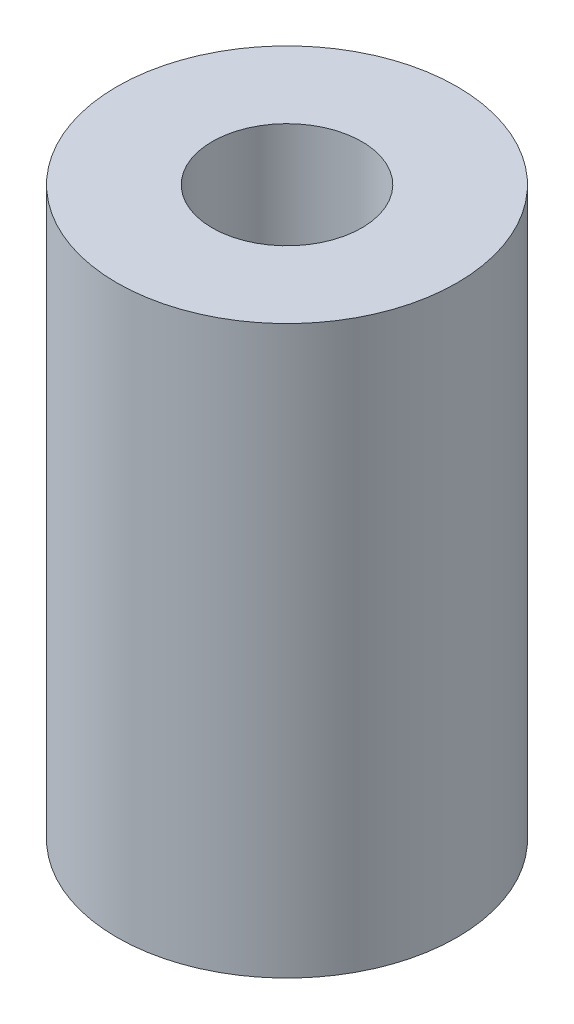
ISO-10303-21;
HEADER;
FILE_DESCRIPTION(('STEP AP214'),'2;1');
FILE_NAME('part.step','',(''),(''),'','','');
FILE_SCHEMA(('AUTOMOTIVE_DESIGN { 1 0 10303 214 1 1 1 1 }'));
ENDSEC;
DATA;
#1=APPLICATION_CONTEXT('core data for automotive mechanical design processes');
#2=APPLICATION_PROTOCOL_DEFINITION('international standard','automotive_design',2000,#1);
#3=PRODUCT_CONTEXT('',#1,'mechanical');
#4=PRODUCT('Part','Part','',(#3));
#5=PRODUCT_RELATED_PRODUCT_CATEGORY('part','',(#4));
#6=PRODUCT_DEFINITION_FORMATION('','',#4);
#7=PRODUCT_DEFINITION_CONTEXT('part definition',#1,'design');
#8=PRODUCT_DEFINITION('design','',#6,#7);
#9=PRODUCT_DEFINITION_SHAPE('','',#8);
#10=(LENGTH_UNIT() NAMED_UNIT(*) SI_UNIT(.MILLI.,.METRE.));
#11=(NAMED_UNIT(*) PLANE_ANGLE_UNIT() SI_UNIT($,.RADIAN.));
#12=(NAMED_UNIT(*) SI_UNIT($,.STERADIAN.) SOLID_ANGLE_UNIT());
#13=UNCERTAINTY_MEASURE_WITH_UNIT(LENGTH_MEASURE(1.E-05),#10,'distance_accuracy_value','');
#14=(GEOMETRIC_REPRESENTATION_CONTEXT(3) GLOBAL_UNCERTAINTY_ASSIGNED_CONTEXT((#13)) GLOBAL_UNIT_ASSIGNED_CONTEXT((#10,
#11,#12)) REPRESENTATION_CONTEXT('',''));
#15=CARTESIAN_POINT('',(0.,0.,0.));
#16=DIRECTION('',(0.,0.,1.));
#17=DIRECTION('',(1.,0.,0.));
#18=AXIS2_PLACEMENT_3D('',#15,#16,#17);
#19=CARTESIAN_POINT('',(0.,25.,0.));
#20=DIRECTION('',(0.,1.,0.));
#21=DIRECTION('',(0.,0.,1.));
#22=AXIS2_PLACEMENT_3D('',#19,#20,#21);
#23=PLANE('',#22);
#24=CARTESIAN_POINT('',(0.,25.,0.));
#25=DIRECTION('',(0.,1.,0.));
#26=DIRECTION('',(0.,0.,1.));
#27=AXIS2_PLACEMENT_3D('',#24,#25,#26);
#28=CIRCLE('',#27,7.5);
#29=CARTESIAN_POINT('',(0.,25.,7.5));
#30=VERTEX_POINT('',#29);
#31=EDGE_CURVE('E10',#30,#30,#28,.T.);
#32=ORIENTED_EDGE('',*,*,#31,.T.);
#33=EDGE_LOOP('',(#32));
#34=FACE_BOUND('',#33,.T.);
#35=CARTESIAN_POINT('',(0.,25.,0.));
#36=DIRECTION('',(0.,1.,0.));
#37=DIRECTION('',(0.,0.,1.));
#38=AXIS2_PLACEMENT_3D('',#35,#36,#37);
#39=CIRCLE('',#38,3.3);
#40=CARTESIAN_POINT('',(0.,25.,3.3));
#41=VERTEX_POINT('',#40);
#42=EDGE_CURVE('E46',#41,#41,#39,.T.);
#43=ORIENTED_EDGE('',*,*,#42,.F.);
#44=EDGE_LOOP('',(#43));
#45=FACE_BOUND('',#44,.T.);
#46=ADVANCED_FACE('F35',(#34,#45),#23,.T.);
#47=CARTESIAN_POINT('',(0.,0.,0.));
#48=DIRECTION('',(0.,1.,0.));
#49=DIRECTION('',(0.,0.,1.));
#50=AXIS2_PLACEMENT_3D('',#47,#48,#49);
#51=PLANE('',#50);
#52=CARTESIAN_POINT('',(0.,0.,0.));
#53=DIRECTION('',(0.,1.,0.));
#54=DIRECTION('',(0.,0.,1.));
#55=AXIS2_PLACEMENT_3D('',#52,#53,#54);
#56=CIRCLE('',#55,7.5);
#57=CARTESIAN_POINT('',(0.,0.,7.5));
#58=VERTEX_POINT('',#57);
#59=EDGE_CURVE('E39',#58,#58,#56,.T.);
#60=ORIENTED_EDGE('',*,*,#59,.F.);
#61=EDGE_LOOP('',(#60));
#62=FACE_BOUND('',#61,.T.);
#63=CARTESIAN_POINT('',(0.,0.,0.));
#64=DIRECTION('',(0.,1.,0.));
#65=DIRECTION('',(0.,0.,1.));
#66=AXIS2_PLACEMENT_3D('',#63,#64,#65);
#67=CIRCLE('',#66,3.3);
#68=CARTESIAN_POINT('',(0.,0.,3.3));
#69=VERTEX_POINT('',#68);
#70=EDGE_CURVE('E48',#69,#69,#67,.T.);
#71=ORIENTED_EDGE('',*,*,#70,.T.);
#72=EDGE_LOOP('',(#71));
#73=FACE_BOUND('',#72,.T.);
#74=ADVANCED_FACE('F58',(#62,#73),#51,.F.);
#75=CARTESIAN_POINT('',(0.,25.,0.));
#76=DIRECTION('',(0.,-1.,0.));
#77=DIRECTION('',(0.,0.,-1.));
#78=AXIS2_PLACEMENT_3D('',#75,#76,#77);
#79=CYLINDRICAL_SURFACE('',#78,7.5);
#80=ORIENTED_EDGE('',*,*,#31,.F.);
#81=EDGE_LOOP('',(#80));
#82=FACE_BOUND('',#81,.T.);
#83=ORIENTED_EDGE('',*,*,#59,.T.);
#84=EDGE_LOOP('',(#83));
#85=FACE_BOUND('',#84,.T.);
#86=ADVANCED_FACE('F37',(#82,#85),#79,.T.);
#87=CARTESIAN_POINT('',(0.,25.,0.));
#88=DIRECTION('',(0.,-1.,0.));
#89=DIRECTION('',(0.,0.,-1.));
#90=AXIS2_PLACEMENT_3D('',#87,#88,#89);
#91=CYLINDRICAL_SURFACE('',#90,3.3);
#92=ORIENTED_EDGE('',*,*,#42,.T.);
#93=EDGE_LOOP('',(#92));
#94=FACE_BOUND('',#93,.T.);
#95=ORIENTED_EDGE('',*,*,#70,.F.);
#96=EDGE_LOOP('',(#95));
#97=FACE_BOUND('',#96,.T.);
#98=ADVANCED_FACE('F54',(#94,#97),#91,.F.);
#99=CLOSED_SHELL('',(#46,#74,#86,#98));
#100=MANIFOLD_SOLID_BREP('B2',#99);
#101=ADVANCED_BREP_SHAPE_REPRESENTATION('',(#18,#100),#14);
#102=SHAPE_DEFINITION_REPRESENTATION(#9,#101);
ENDSEC;
END-ISO-10303-21;
